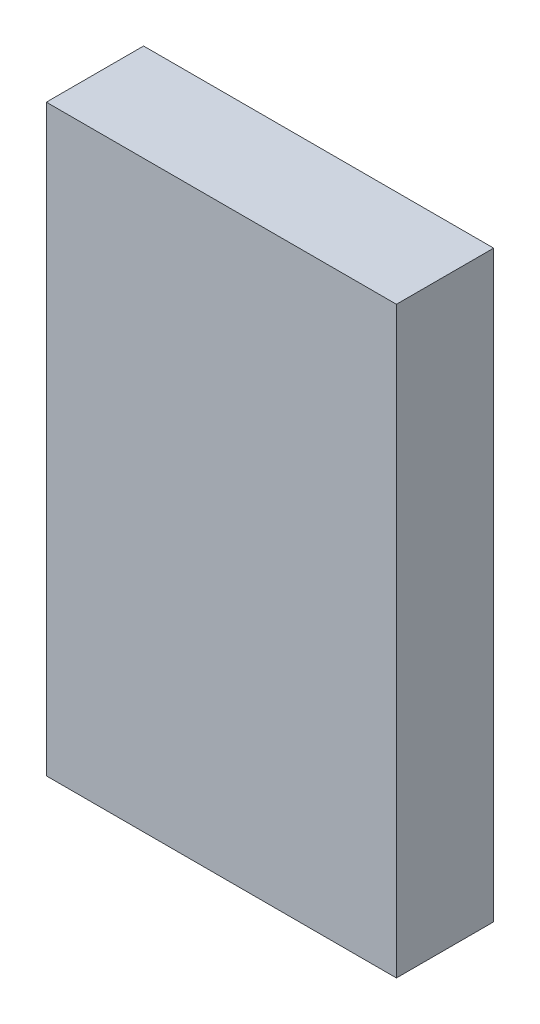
from build123d import *

# Parameters (mm, degrees)
ESQUISSE1_W        = 90
ESQUISSE1_H        = 150
BOSS_EXTRU_1_DEPTH = 25


with BuildPart() as part:
    # Esquisse1 → Boss.-Extru.1 (new body)
    with BuildSketch(Plane.XY):
        with Locations((45, 75)):
            Rectangle(ESQUISSE1_W, ESQUISSE1_H)
    extrude(amount=BOSS_EXTRU_1_DEPTH)


solid = part.part
